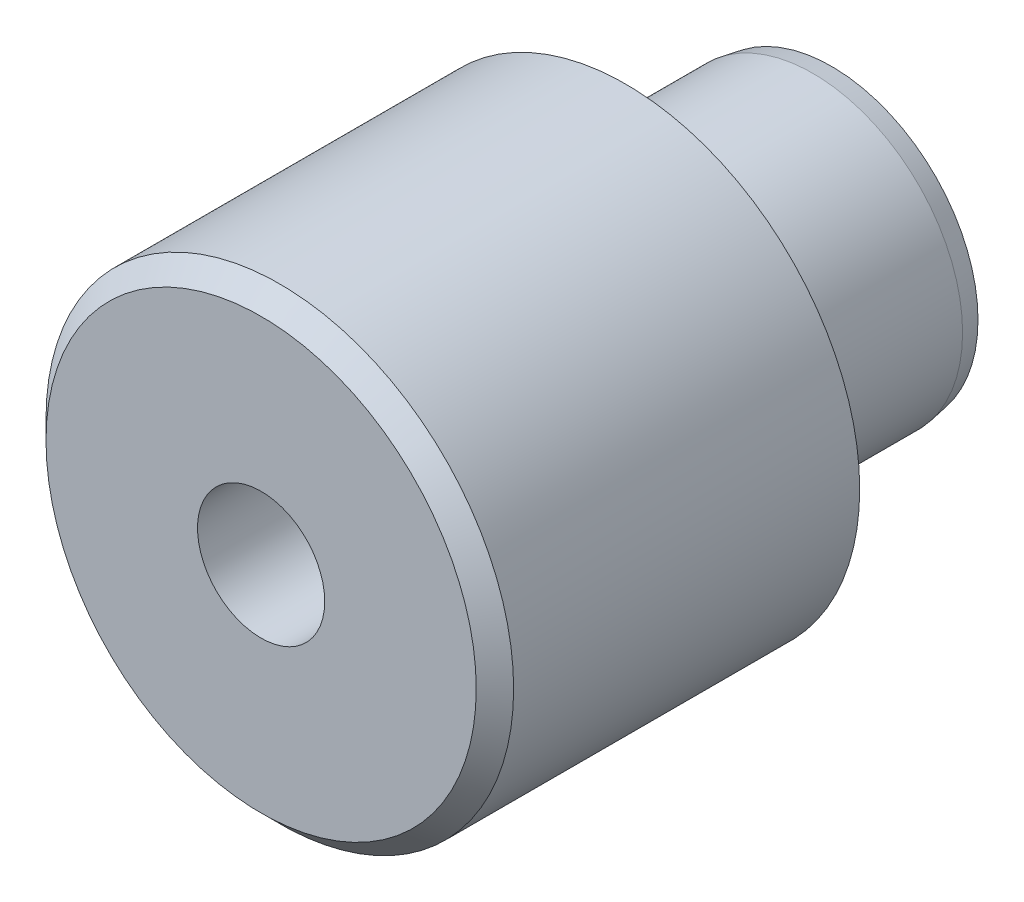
from build123d import *

# Parameters (mm, degrees)
SHOULDERFV_W                         = 12.5
SHOULDERFV_H                         = 19.5
M8X1_25_BOTTOMING_TAPPED_HOLE1_D     = 6.8
M8X1_25_BOTTOMING_TAPPED_HOLE1_DEPTH = 19
M8X1_25_BOTTOMING_TAPPED_HOLE1_TIP   = 2.042926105
FILLET1_R                            = 0.8
CHAMFER1_SIZE                        = 1


with BuildPart() as part:
    # ShoulderFV → Revolve1 (revolve)
    with BuildSketch(Plane(origin=(0, 0, 0), x_dir=(1, 0, 0), z_dir=(0, 1, 0))):
        with Locations((6.25, -10.25)):
            Rectangle(SHOULDERFV_W, SHOULDERFV_H)
    revolve(axis=Axis((0, 0, 0.5), (0, 0, -1)))

    # PinFV → Revolve2 (revolve)
    with BuildSketch(Plane(origin=(0, 0, 0), x_dir=(1, 0, 0), z_dir=(0, 1, 0))):
        Polygon((0, -0.5), (0, 10.5), (7.823673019, 10.5), (8, 9.5), (8, -0.5), align=None)
    revolve(axis=Axis((0, 0, -10.5), (0, 0, -1)))

    # M8x1.25 Bottoming Tapped Hole1
    with Locations(Plane.XY.offset(20)):
        with Locations((0, 0)):
            Hole(M8X1_25_BOTTOMING_TAPPED_HOLE1_D / 2, depth=M8X1_25_BOTTOMING_TAPPED_HOLE1_DEPTH)
            with Locations((0, 0, -(M8X1_25_BOTTOMING_TAPPED_HOLE1_DEPTH + M8X1_25_BOTTOMING_TAPPED_HOLE1_TIP / 2))):  # 118° drill point
                Cone(0, M8X1_25_BOTTOMING_TAPPED_HOLE1_D / 2, M8X1_25_BOTTOMING_TAPPED_HOLE1_TIP, mode=Mode.SUBTRACT)

    # Fillet1
    fillet1_edges = [part.edges().sort_by_distance(p)[0] for p in [
        (-8, 0, 0.5),
    ]]
    fillet(fillet1_edges, radius=FILLET1_R)

    # Chamfer1
    chamfer1_edges = [part.edges().sort_by_distance(p)[0] for p in [
        (-12.5, 0, 20),
    ]]
    chamfer(chamfer1_edges, length=CHAMFER1_SIZE)


solid = part.part
